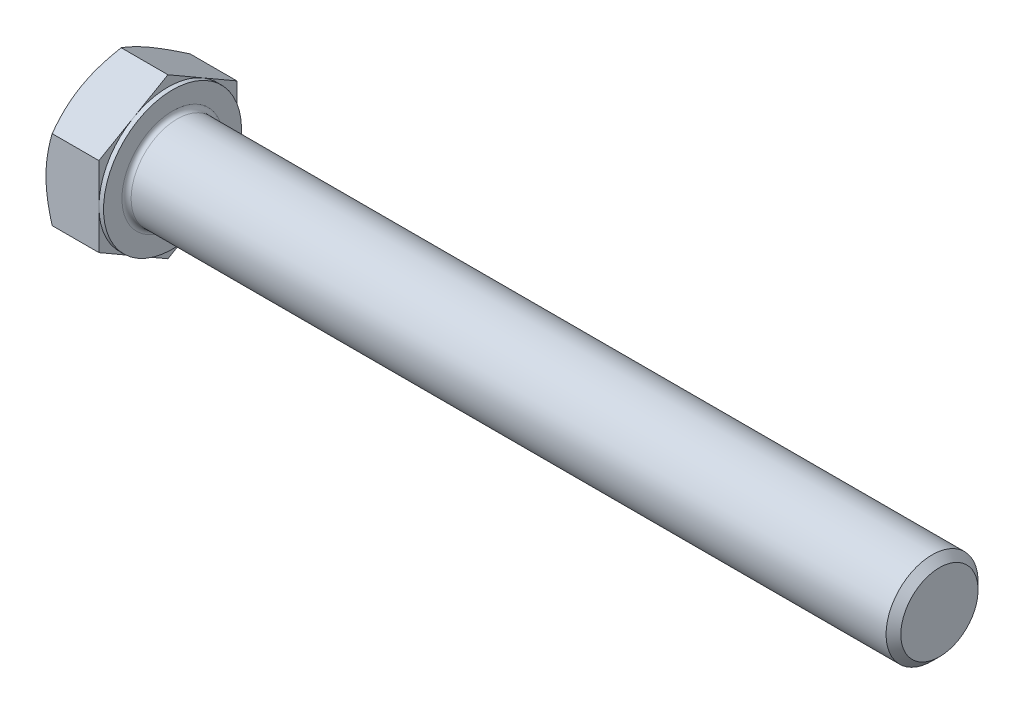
ISO-10303-21;
HEADER;
FILE_DESCRIPTION(('STEP AP214'),'2;1');
FILE_NAME('part.step','',(''),(''),'','','');
FILE_SCHEMA(('AUTOMOTIVE_DESIGN { 1 0 10303 214 1 1 1 1 }'));
ENDSEC;
DATA;
#1=APPLICATION_CONTEXT('core data for automotive mechanical design processes');
#2=APPLICATION_PROTOCOL_DEFINITION('international standard','automotive_design',2000,#1);
#3=PRODUCT_CONTEXT('',#1,'mechanical');
#4=PRODUCT('Part','Part','',(#3));
#5=PRODUCT_RELATED_PRODUCT_CATEGORY('part','',(#4));
#6=PRODUCT_DEFINITION_FORMATION('','',#4);
#7=PRODUCT_DEFINITION_CONTEXT('part definition',#1,'design');
#8=PRODUCT_DEFINITION('design','',#6,#7);
#9=PRODUCT_DEFINITION_SHAPE('','',#8);
#10=(LENGTH_UNIT() NAMED_UNIT(*) SI_UNIT(.MILLI.,.METRE.));
#11=(NAMED_UNIT(*) PLANE_ANGLE_UNIT() SI_UNIT($,.RADIAN.));
#12=(NAMED_UNIT(*) SI_UNIT($,.STERADIAN.) SOLID_ANGLE_UNIT());
#13=UNCERTAINTY_MEASURE_WITH_UNIT(LENGTH_MEASURE(1.E-05),#10,'distance_accuracy_value','');
#14=(GEOMETRIC_REPRESENTATION_CONTEXT(3) GLOBAL_UNCERTAINTY_ASSIGNED_CONTEXT((#13)) GLOBAL_UNIT_ASSIGNED_CONTEXT((#10,
#11,#12)) REPRESENTATION_CONTEXT('',''));
#15=CARTESIAN_POINT('',(0.,0.,0.));
#16=DIRECTION('',(0.,0.,1.));
#17=DIRECTION('',(1.,0.,0.));
#18=AXIS2_PLACEMENT_3D('',#15,#16,#17);
#19=CARTESIAN_POINT('',(7.5,10.3923048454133,0.));
#20=DIRECTION('',(1.,0.,0.));
#21=DIRECTION('',(0.,0.,-1.));
#22=AXIS2_PLACEMENT_3D('',#19,#20,#21);
#23=PLANE('',#22);
#24=CARTESIAN_POINT('',(7.5,0.,0.));
#25=DIRECTION('',(1.,0.,0.));
#26=DIRECTION('',(0.,0.,-1.));
#27=AXIS2_PLACEMENT_3D('',#24,#25,#26);
#28=CIRCLE('',#27,6.6);
#29=CARTESIAN_POINT('',(7.5,0.,-6.6));
#30=VERTEX_POINT('',#29);
#31=EDGE_CURVE('E40',#30,#30,#28,.F.);
#32=ORIENTED_EDGE('',*,*,#31,.T.);
#33=EDGE_LOOP('',(#32));
#34=FACE_BOUND('',#33,.T.);
#35=CARTESIAN_POINT('',(7.5,0.,0.));
#36=DIRECTION('',(1.,0.,0.));
#37=DIRECTION('',(0.,0.,-1.));
#38=AXIS2_PLACEMENT_3D('',#35,#36,#37);
#39=CIRCLE('',#38,9.);
#40=CARTESIAN_POINT('',(7.5,0.,-9.));
#41=VERTEX_POINT('',#40);
#42=EDGE_CURVE('E297',#41,#41,#39,.T.);
#43=ORIENTED_EDGE('',*,*,#42,.T.);
#44=EDGE_LOOP('',(#43));
#45=FACE_BOUND('',#44,.T.);
#46=ADVANCED_FACE('F32',(#34,#45),#23,.T.);
#47=CARTESIAN_POINT('',(0.,0.,0.));
#48=DIRECTION('',(-1.,0.,0.));
#49=DIRECTION('',(0.,0.,1.));
#50=AXIS2_PLACEMENT_3D('',#47,#48,#49);
#51=CYLINDRICAL_SURFACE('',#50,6.);
#52=CARTESIAN_POINT('',(8.1,0.,0.));
#53=DIRECTION('',(1.,0.,0.));
#54=DIRECTION('',(0.,0.,-1.));
#55=AXIS2_PLACEMENT_3D('',#52,#53,#54);
#56=CIRCLE('',#55,6.);
#57=CARTESIAN_POINT('',(8.1,0.,-6.));
#58=VERTEX_POINT('',#57);
#59=EDGE_CURVE('E11',#58,#58,#56,.T.);
#60=ORIENTED_EDGE('',*,*,#59,.T.);
#61=EDGE_LOOP('',(#60));
#62=FACE_BOUND('',#61,.T.);
#63=CARTESIAN_POINT('',(106.536,0.,0.));
#64=DIRECTION('',(-1.,0.,0.));
#65=DIRECTION('',(0.,0.,1.));
#66=AXIS2_PLACEMENT_3D('',#63,#64,#65);
#67=CIRCLE('',#66,6.);
#68=CARTESIAN_POINT('',(106.536,0.,6.));
#69=VERTEX_POINT('',#68);
#70=EDGE_CURVE('E276',#69,#69,#67,.T.);
#71=ORIENTED_EDGE('',*,*,#70,.T.);
#72=EDGE_LOOP('',(#71));
#73=FACE_BOUND('',#72,.T.);
#74=ADVANCED_FACE('F250',(#62,#73),#51,.T.);
#75=CARTESIAN_POINT('',(107.5,0.,0.));
#76=DIRECTION('',(-1.,0.,0.));
#77=DIRECTION('',(0.,0.,1.));
#78=AXIS2_PLACEMENT_3D('',#75,#76,#77);
#79=CONICAL_SURFACE('',#78,5.036,0.78539816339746);
#80=ORIENTED_EDGE('',*,*,#70,.F.);
#81=EDGE_LOOP('',(#80));
#82=FACE_BOUND('',#81,.T.);
#83=CARTESIAN_POINT('',(107.5,0.,0.));
#84=DIRECTION('',(-1.,0.,0.));
#85=DIRECTION('',(0.,0.,1.));
#86=AXIS2_PLACEMENT_3D('',#83,#84,#85);
#87=CIRCLE('',#86,5.036);
#88=CARTESIAN_POINT('',(107.5,0.,5.036));
#89=VERTEX_POINT('',#88);
#90=EDGE_CURVE('E274',#89,#89,#87,.T.);
#91=ORIENTED_EDGE('',*,*,#90,.T.);
#92=EDGE_LOOP('',(#91));
#93=FACE_BOUND('',#92,.T.);
#94=ADVANCED_FACE('F255',(#82,#93),#79,.T.);
#95=CARTESIAN_POINT('',(107.5,0.,0.));
#96=DIRECTION('',(-1.,0.,0.));
#97=DIRECTION('',(0.,0.,1.));
#98=AXIS2_PLACEMENT_3D('',#95,#96,#97);
#99=PLANE('',#98);
#100=ORIENTED_EDGE('',*,*,#90,.F.);
#101=EDGE_LOOP('',(#100));
#102=FACE_BOUND('',#101,.T.);
#103=ADVANCED_FACE('F262',(#102),#99,.F.);
#104=CARTESIAN_POINT('',(6.9,9.,0.));
#105=DIRECTION('',(1.,0.,0.));
#106=DIRECTION('',(0.,0.,-1.));
#107=AXIS2_PLACEMENT_3D('',#104,#105,#106);
#108=PLANE('',#107);
#109=DIRECTION('',(0.,0.500000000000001,0.866025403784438));
#110=VECTOR('',#109,1.);
#111=CARTESIAN_POINT('',(6.9,5.19615242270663,-9.));
#112=LINE('',#111,#110);
#113=CARTESIAN_POINT('',(6.9,5.19615242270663,-9.));
#114=VERTEX_POINT('',#113);
#115=CARTESIAN_POINT('',(6.9,7.79422863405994,-4.50000000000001));
#116=VERTEX_POINT('',#115);
#117=EDGE_CURVE('E164',#114,#116,#112,.T.);
#118=ORIENTED_EDGE('',*,*,#117,.T.);
#119=CARTESIAN_POINT('',(6.9,0.,0.));
#120=DIRECTION('',(-1.,0.,0.));
#121=DIRECTION('',(0.,0.,1.));
#122=AXIS2_PLACEMENT_3D('',#119,#120,#121);
#123=CIRCLE('',#122,9.);
#124=CARTESIAN_POINT('',(6.9,0.,-9.));
#125=VERTEX_POINT('',#124);
#126=EDGE_CURVE('E47',#116,#125,#123,.T.);
#127=ORIENTED_EDGE('',*,*,#126,.T.);
#128=DIRECTION('',(0.,1.,0.));
#129=VECTOR('',#128,1.);
#130=CARTESIAN_POINT('',(6.9,5.19615242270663,-9.));
#131=LINE('',#130,#129);
#132=EDGE_CURVE('E300',#125,#114,#131,.T.);
#133=ORIENTED_EDGE('',*,*,#132,.T.);
#134=EDGE_LOOP('',(#118,#127,#133));
#135=FACE_BOUND('',#134,.T.);
#136=ADVANCED_FACE('F265',(#135),#108,.T.);
#137=CARTESIAN_POINT('',(6.9,10.3923048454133,0.));
#138=VERTEX_POINT('',#137);
#139=EDGE_CURVE('E162',#116,#138,#112,.T.);
#140=ORIENTED_EDGE('',*,*,#139,.T.);
#141=DIRECTION('',(0.,-0.500000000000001,0.866025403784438));
#142=VECTOR('',#141,1.);
#143=CARTESIAN_POINT('',(6.9,10.3923048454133,0.));
#144=LINE('',#143,#142);
#145=CARTESIAN_POINT('',(6.9,7.79422863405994,4.50000000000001));
#146=VERTEX_POINT('',#145);
#147=EDGE_CURVE('E161',#138,#146,#144,.T.);
#148=ORIENTED_EDGE('',*,*,#147,.T.);
#149=EDGE_CURVE('E150',#146,#116,#123,.T.);
#150=ORIENTED_EDGE('',*,*,#149,.T.);
#151=EDGE_LOOP('',(#140,#148,#150));
#152=FACE_BOUND('',#151,.T.);
#153=ADVANCED_FACE('F270',(#152),#108,.T.);
#154=CARTESIAN_POINT('',(6.9,5.19615242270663,9.));
#155=VERTEX_POINT('',#154);
#156=EDGE_CURVE('E129',#146,#155,#144,.T.);
#157=ORIENTED_EDGE('',*,*,#156,.T.);
#158=DIRECTION('',(0.,-1.,0.));
#159=VECTOR('',#158,1.);
#160=CARTESIAN_POINT('',(6.9,5.19615242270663,9.));
#161=LINE('',#160,#159);
#162=CARTESIAN_POINT('',(6.9,0.,9.));
#163=VERTEX_POINT('',#162);
#164=EDGE_CURVE('E123',#155,#163,#161,.T.);
#165=ORIENTED_EDGE('',*,*,#164,.T.);
#166=EDGE_CURVE('E127',#163,#146,#123,.T.);
#167=ORIENTED_EDGE('',*,*,#166,.T.);
#168=EDGE_LOOP('',(#157,#165,#167));
#169=FACE_BOUND('',#168,.T.);
#170=ADVANCED_FACE('F125',(#169),#108,.T.);
#171=CARTESIAN_POINT('',(6.9,-5.1961524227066,9.));
#172=VERTEX_POINT('',#171);
#173=EDGE_CURVE('E133',#163,#172,#161,.T.);
#174=ORIENTED_EDGE('',*,*,#173,.T.);
#175=DIRECTION('',(0.,-0.500000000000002,-0.866025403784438));
#176=VECTOR('',#175,1.);
#177=CARTESIAN_POINT('',(6.9,-10.3923048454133,0.));
#178=LINE('',#177,#176);
#179=CARTESIAN_POINT('',(6.9,-7.79422863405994,4.50000000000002));
#180=VERTEX_POINT('',#179);
#181=EDGE_CURVE('E140',#172,#180,#178,.T.);
#182=ORIENTED_EDGE('',*,*,#181,.T.);
#183=EDGE_CURVE('E137',#180,#163,#123,.T.);
#184=ORIENTED_EDGE('',*,*,#183,.T.);
#185=EDGE_LOOP('',(#174,#182,#184));
#186=FACE_BOUND('',#185,.T.);
#187=ADVANCED_FACE('F138',(#186),#108,.T.);
#188=CARTESIAN_POINT('',(6.9,-10.3923048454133,0.));
#189=VERTEX_POINT('',#188);
#190=EDGE_CURVE('E156',#180,#189,#178,.T.);
#191=ORIENTED_EDGE('',*,*,#190,.T.);
#192=DIRECTION('',(0.,0.499999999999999,-0.866025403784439));
#193=VECTOR('',#192,1.);
#194=CARTESIAN_POINT('',(6.9,-5.19615242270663,-9.));
#195=LINE('',#194,#193);
#196=CARTESIAN_POINT('',(6.9,-7.79422863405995,-4.49999999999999));
#197=VERTEX_POINT('',#196);
#198=EDGE_CURVE('E338',#189,#197,#195,.T.);
#199=ORIENTED_EDGE('',*,*,#198,.T.);
#200=EDGE_CURVE('E144',#197,#180,#123,.T.);
#201=ORIENTED_EDGE('',*,*,#200,.T.);
#202=EDGE_LOOP('',(#191,#199,#201));
#203=FACE_BOUND('',#202,.T.);
#204=ADVANCED_FACE('F339',(#203),#108,.T.);
#205=CARTESIAN_POINT('',(6.9,-5.19615242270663,-9.));
#206=VERTEX_POINT('',#205);
#207=EDGE_CURVE('E151',#197,#206,#195,.T.);
#208=ORIENTED_EDGE('',*,*,#207,.T.);
#209=EDGE_CURVE('E301',#206,#125,#131,.T.);
#210=ORIENTED_EDGE('',*,*,#209,.T.);
#211=EDGE_CURVE('E308',#125,#197,#123,.T.);
#212=ORIENTED_EDGE('',*,*,#211,.T.);
#213=EDGE_LOOP('',(#208,#210,#212));
#214=FACE_BOUND('',#213,.T.);
#215=ADVANCED_FACE('F271',(#214),#108,.T.);
#216=CARTESIAN_POINT('',(0.,0.,0.));
#217=DIRECTION('',(-1.,0.,0.));
#218=DIRECTION('',(0.,0.,1.));
#219=AXIS2_PLACEMENT_3D('',#216,#217,#218);
#220=CYLINDRICAL_SURFACE('',#219,9.);
#221=ORIENTED_EDGE('',*,*,#126,.F.);
#222=ORIENTED_EDGE('',*,*,#149,.F.);
#223=ORIENTED_EDGE('',*,*,#166,.F.);
#224=ORIENTED_EDGE('',*,*,#183,.F.);
#225=ORIENTED_EDGE('',*,*,#200,.F.);
#226=ORIENTED_EDGE('',*,*,#211,.F.);
#227=EDGE_LOOP('',(#221,#222,#223,#224,#225,#226));
#228=FACE_BOUND('',#227,.T.);
#229=ORIENTED_EDGE('',*,*,#42,.F.);
#230=EDGE_LOOP('',(#229));
#231=FACE_BOUND('',#230,.T.);
#232=ADVANCED_FACE('F147',(#228,#231),#220,.T.);
#233=CARTESIAN_POINT('',(0.,10.3923048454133,0.));
#234=DIRECTION('',(1.,0.,0.));
#235=DIRECTION('',(0.,0.,-1.));
#236=AXIS2_PLACEMENT_3D('',#233,#234,#235);
#237=PLANE('',#236);
#238=CARTESIAN_POINT('',(0.,0.,0.));
#239=DIRECTION('',(1.,0.,0.));
#240=DIRECTION('',(0.,0.,-1.));
#241=AXIS2_PLACEMENT_3D('',#238,#239,#240);
#242=CIRCLE('',#241,9.);
#243=CARTESIAN_POINT('',(0.,0.,-9.));
#244=VERTEX_POINT('',#243);
#245=CARTESIAN_POINT('',(0.,7.79422863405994,-4.50000000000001));
#246=VERTEX_POINT('',#245);
#247=EDGE_CURVE('E296',#244,#246,#242,.T.);
#248=ORIENTED_EDGE('',*,*,#247,.F.);
#249=CARTESIAN_POINT('',(0.,-7.79422863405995,-4.49999999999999));
#250=VERTEX_POINT('',#249);
#251=EDGE_CURVE('E292',#250,#244,#242,.T.);
#252=ORIENTED_EDGE('',*,*,#251,.F.);
#253=CARTESIAN_POINT('',(0.,-7.79422863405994,4.50000000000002));
#254=VERTEX_POINT('',#253);
#255=EDGE_CURVE('E295',#254,#250,#242,.T.);
#256=ORIENTED_EDGE('',*,*,#255,.F.);
#257=CARTESIAN_POINT('',(0.,0.,9.));
#258=VERTEX_POINT('',#257);
#259=EDGE_CURVE('E331',#258,#254,#242,.T.);
#260=ORIENTED_EDGE('',*,*,#259,.F.);
#261=CARTESIAN_POINT('',(0.,0.,0.));
#262=DIRECTION('',(-1.,0.,0.));
#263=DIRECTION('',(0.,0.,1.));
#264=AXIS2_PLACEMENT_3D('',#261,#262,#263);
#265=CIRCLE('',#264,9.);
#266=CARTESIAN_POINT('',(0.,7.79422863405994,4.50000000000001));
#267=VERTEX_POINT('',#266);
#268=EDGE_CURVE('E165',#258,#267,#265,.T.);
#269=ORIENTED_EDGE('',*,*,#268,.T.);
#270=EDGE_CURVE('E354',#246,#267,#242,.T.);
#271=ORIENTED_EDGE('',*,*,#270,.F.);
#272=EDGE_LOOP('',(#248,#252,#256,#260,#269,#271));
#273=FACE_BOUND('',#272,.T.);
#274=ADVANCED_FACE('F196',(#273),#237,.F.);
#275=CARTESIAN_POINT('',(0.,0.,0.));
#276=DIRECTION('',(1.,0.,0.));
#277=DIRECTION('',(0.,0.,-1.));
#278=AXIS2_PLACEMENT_3D('',#275,#276,#277);
#279=CONICAL_SURFACE('',#278,9.,1.0471975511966);
#280=CARTESIAN_POINT('',(0.803914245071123,5.19603695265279,9.0002));
#281=CARTESIAN_POINT('',(0.737982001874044,5.31024090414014,8.80239295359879));
#282=CARTESIAN_POINT('',(0.675041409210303,5.42489028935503,8.60381439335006));
#283=CARTESIAN_POINT('',(0.555968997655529,5.65512011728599,8.20504463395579));
#284=CARTESIAN_POINT('',(0.499840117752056,5.77070093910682,8.00485277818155));
#285=CARTESIAN_POINT('',(0.395151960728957,6.00300811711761,7.60248494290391));
#286=CARTESIAN_POINT('',(0.346610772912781,6.11973652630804,7.40030540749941));
#287=CARTESIAN_POINT('',(0.258148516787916,6.35398725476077,6.99457124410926));
#288=CARTESIAN_POINT('',(0.218225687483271,6.47150940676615,6.7910169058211));
#289=CARTESIAN_POINT('',(0.148684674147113,6.70436794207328,6.38769409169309));
#290=CARTESIAN_POINT('',(0.118837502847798,6.81968712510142,6.187955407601));
#291=CARTESIAN_POINT('',(0.0687933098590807,7.05084147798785,5.78758432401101));
#292=CARTESIAN_POINT('',(0.04859543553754,7.16667660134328,5.5869520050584));
#293=CARTESIAN_POINT('',(0.0183543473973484,7.39854776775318,5.18533936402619));
#294=CARTESIAN_POINT('',(0.00829960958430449,7.51458343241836,4.98435969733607));
#295=CARTESIAN_POINT('',(-0.00143766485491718,7.74676155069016,4.58221540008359));
#296=CARTESIAN_POINT('',(-0.00112052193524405,7.86290400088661,4.38105077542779));
#297=CARTESIAN_POINT('',(0.00916395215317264,8.08003584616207,4.00496738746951));
#298=CARTESIAN_POINT('',(0.0178767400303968,8.18104055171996,3.83002210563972));
#299=CARTESIAN_POINT('',(0.0429773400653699,8.38281337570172,3.48054132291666));
#300=CARTESIAN_POINT('',(0.0593656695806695,8.4835814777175,3.30600585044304));
#301=CARTESIAN_POINT('',(0.11965655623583,8.7854956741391,2.7830751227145));
#302=CARTESIAN_POINT('',(0.174677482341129,8.98610736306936,2.43560548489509));
#303=CARTESIAN_POINT('',(0.312230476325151,9.38945876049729,1.73698037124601));
#304=CARTESIAN_POINT('',(0.395345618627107,9.59214699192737,1.38591405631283));
#305=CARTESIAN_POINT('',(0.583982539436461,9.99450087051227,0.689016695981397));
#306=CARTESIAN_POINT('',(0.689460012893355,10.1941716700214,0.343176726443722));
#307=CARTESIAN_POINT('',(0.803914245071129,10.3924203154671,-0.000200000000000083));
#308=B_SPLINE_CURVE_WITH_KNOTS('',3,(#280,#281,#282,#283,#284,#285,#286,#287,#288,#289,#290,
#291,#292,#293,#294,#295,#296,#297,#298,#299,#300,#301,#302,#303,#304,#305,#306,#307),
.UNSPECIFIED.,.F.,.F.,(4,2,2,2,2,2,2,2,2,2,2,2,2,4),(0.,0.713219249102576,1.42674513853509,
2.14194697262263,2.8570025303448,3.55449749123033,4.25193080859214,4.94857085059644,
5.64518936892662,6.25162976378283,6.8581110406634,8.07193747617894,9.31268391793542,
10.5509947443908),.UNSPECIFIED.);
#309=CARTESIAN_POINT('',(0.803847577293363,10.3923048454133,0.));
#310=VERTEX_POINT('',#309);
#311=EDGE_CURVE('E216',#267,#310,#308,.T.);
#312=ORIENTED_EDGE('',*,*,#311,.T.);
#313=CARTESIAN_POINT('',(0.803914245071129,10.3924203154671,0.000200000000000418));
#314=CARTESIAN_POINT('',(0.73798200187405,10.2782163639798,-0.197607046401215));
#315=CARTESIAN_POINT('',(0.675041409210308,10.1635669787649,-0.396185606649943));
#316=CARTESIAN_POINT('',(0.555968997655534,9.93333715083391,-0.794955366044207));
#317=CARTESIAN_POINT('',(0.499840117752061,9.81775632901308,-0.995147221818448));
#318=CARTESIAN_POINT('',(0.395151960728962,9.58544915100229,-1.39751505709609));
#319=CARTESIAN_POINT('',(0.346610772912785,9.46872074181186,-1.59969459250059));
#320=CARTESIAN_POINT('',(0.25814851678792,9.23447001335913,-2.00542875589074));
#321=CARTESIAN_POINT('',(0.218225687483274,9.11694786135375,-2.20898309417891));
#322=CARTESIAN_POINT('',(0.148684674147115,8.88408932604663,-2.61230590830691));
#323=CARTESIAN_POINT('',(0.1188375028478,8.76877014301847,-2.812044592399));
#324=CARTESIAN_POINT('',(0.0687933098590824,8.53761579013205,-3.21241567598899));
#325=CARTESIAN_POINT('',(0.048595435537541,8.42178066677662,-3.4130479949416));
#326=CARTESIAN_POINT('',(0.0183543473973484,8.18990950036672,-3.81466063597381));
#327=CARTESIAN_POINT('',(0.00829960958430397,8.07387383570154,-4.01564030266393));
#328=CARTESIAN_POINT('',(-0.00143766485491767,7.84169571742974,-4.41778459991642));
#329=CARTESIAN_POINT('',(-0.00112052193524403,7.72555326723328,-4.61894922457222));
#330=CARTESIAN_POINT('',(0.00916395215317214,7.50842142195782,-4.9950326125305));
#331=CARTESIAN_POINT('',(0.0178767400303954,7.40741671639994,-5.16997789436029));
#332=CARTESIAN_POINT('',(0.042977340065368,7.20564389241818,-5.51945867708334));
#333=CARTESIAN_POINT('',(0.0593656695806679,7.1048757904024,-5.69399414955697));
#334=CARTESIAN_POINT('',(0.119656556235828,6.8029615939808,-6.2169248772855));
#335=CARTESIAN_POINT('',(0.174677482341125,6.60234990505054,-6.56439451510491));
#336=CARTESIAN_POINT('',(0.312230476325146,6.1989985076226,-7.263019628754));
#337=CARTESIAN_POINT('',(0.395345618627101,5.99631027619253,-7.61408594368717));
#338=CARTESIAN_POINT('',(0.583982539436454,5.59395639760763,-8.3109833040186));
#339=CARTESIAN_POINT('',(0.689460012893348,5.39428559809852,-8.65682327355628));
#340=CARTESIAN_POINT('',(0.803914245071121,5.19603695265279,-9.0002));
#341=B_SPLINE_CURVE_WITH_KNOTS('',3,(#313,#314,#315,#316,#317,#318,#319,#320,#321,#322,#323,
#324,#325,#326,#327,#328,#329,#330,#331,#332,#333,#334,#335,#336,#337,#338,#339,#340),
.UNSPECIFIED.,.F.,.F.,(4,2,2,2,2,2,2,2,2,2,2,2,2,4),(0.,0.713219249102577,1.42674513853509,
2.14194697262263,2.8570025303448,3.55449749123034,4.25193080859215,4.94857085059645,
5.64518936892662,6.25162976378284,6.85811104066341,8.07193747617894,9.31268391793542,
10.5509947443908),.UNSPECIFIED.);
#342=EDGE_CURVE('E55',#310,#246,#341,.T.);
#343=ORIENTED_EDGE('',*,*,#342,.T.);
#344=ORIENTED_EDGE('',*,*,#270,.T.);
#345=EDGE_LOOP('',(#312,#343,#344));
#346=FACE_BOUND('',#345,.T.);
#347=ADVANCED_FACE('F355',(#346),#279,.T.);
#348=CARTESIAN_POINT('',(4.5030834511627,-14.1853984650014,8.99999999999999));
#349=CARTESIAN_POINT('',(4.31054430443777,-13.7903499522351,8.99999999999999));
#350=CARTESIAN_POINT('',(4.11978647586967,-13.3944187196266,8.99999999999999));
#351=CARTESIAN_POINT('',(3.74283090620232,-12.6003222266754,8.99999999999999));
#352=CARTESIAN_POINT('',(3.55663384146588,-12.2021566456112,9.));
#353=CARTESIAN_POINT('',(3.18890856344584,-11.4011783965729,9.));
#354=CARTESIAN_POINT('',(3.00740939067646,-10.9983523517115,9.));
#355=CARTESIAN_POINT('',(2.65153988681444,-10.1895752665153,9.));
#356=CARTESIAN_POINT('',(2.47716923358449,-9.7836243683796,9.));
#357=CARTESIAN_POINT('',(2.13161244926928,-8.95398189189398,9.));
#358=CARTESIAN_POINT('',(1.96074001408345,-8.53015895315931,9.));
#359=CARTESIAN_POINT('',(1.63138410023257,-7.67764040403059,9.));
#360=CARTESIAN_POINT('',(1.47290197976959,-7.24894426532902,9.));
#361=CARTESIAN_POINT('',(1.17232155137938,-6.38672363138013,9.));
#362=CARTESIAN_POINT('',(1.03019194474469,-5.95321016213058,9.));
#363=CARTESIAN_POINT('',(0.766724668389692,-5.07998336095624,9.));
#364=CARTESIAN_POINT('',(0.645380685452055,-4.64027195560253,9.));
#365=CARTESIAN_POINT('',(0.429822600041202,-3.75682505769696,9.));
#366=CARTESIAN_POINT('',(0.335452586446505,-3.31312863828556,9.));
#367=CARTESIAN_POINT('',(0.218090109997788,-2.64336713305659,9.));
#368=CARTESIAN_POINT('',(0.182999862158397,-2.41939560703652,9.));
#369=CARTESIAN_POINT('',(0.121565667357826,-1.97026354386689,9.));
#370=CARTESIAN_POINT('',(0.0952208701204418,-1.74510312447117,9.));
#371=CARTESIAN_POINT('',(0.0521451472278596,-1.2969348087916,9.));
#372=CARTESIAN_POINT('',(0.0352889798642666,-1.0739390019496,9.));
#373=CARTESIAN_POINT('',(0.0110310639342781,-0.627433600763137,9.));
#374=CARTESIAN_POINT('',(0.00362915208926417,-0.403924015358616,9.));
#375=CARTESIAN_POINT('',(-0.00154262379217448,0.0432079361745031,9.));
#376=CARTESIAN_POINT('',(0.000687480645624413,0.266830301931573,9.));
#377=CARTESIAN_POINT('',(0.0147226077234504,0.713776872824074,9.));
#378=CARTESIAN_POINT('',(0.0265280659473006,0.937101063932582,9.));
#379=CARTESIAN_POINT('',(0.0656502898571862,1.46707211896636,9.));
#380=CARTESIAN_POINT('',(0.0971347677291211,1.77341845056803,9.));
#381=CARTESIAN_POINT('',(0.176454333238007,2.38397028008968,9.));
#382=CARTESIAN_POINT('',(0.224291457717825,2.68817550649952,9.));
#383=CARTESIAN_POINT('',(0.38980640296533,3.59715813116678,9.));
#384=CARTESIAN_POINT('',(0.529461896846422,4.19799412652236,9.));
#385=CARTESIAN_POINT('',(0.77333187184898,5.09670706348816,9.));
#386=CARTESIAN_POINT('',(0.861532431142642,5.39919910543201,9.));
#387=CARTESIAN_POINT('',(1.04752099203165,6.00125026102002,9.));
#388=CARTESIAN_POINT('',(1.14530906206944,6.30080935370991,9.));
#389=CARTESIAN_POINT('',(1.34886866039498,6.89708058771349,9.));
#390=CARTESIAN_POINT('',(1.45463787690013,7.19379352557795,9.));
#391=CARTESIAN_POINT('',(1.67287301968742,7.78473287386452,9.));
#392=CARTESIAN_POINT('',(1.78533883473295,8.07895932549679,9.));
#393=CARTESIAN_POINT('',(2.07523735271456,8.81619444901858,9.));
#394=CARTESIAN_POINT('',(2.25629467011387,9.25777584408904,9.));
#395=CARTESIAN_POINT('',(2.62827522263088,10.1367776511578,9.));
#396=CARTESIAN_POINT('',(2.819199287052,10.5741977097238,9.));
#397=CARTESIAN_POINT('',(3.20877963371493,11.4457286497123,9.));
#398=CARTESIAN_POINT('',(3.40743823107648,11.8798384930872,9.));
#399=CARTESIAN_POINT('',(3.81079737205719,12.7452179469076,9.));
#400=CARTESIAN_POINT('',(4.01549773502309,13.176487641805,9.00000000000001));
#401=CARTESIAN_POINT('',(4.43000777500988,14.0372827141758,9.00000000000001));
#402=CARTESIAN_POINT('',(4.63982402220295,14.4668049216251,9.00000000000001));
#403=CARTESIAN_POINT('',(5.06336871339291,15.3239162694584,9.00000000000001));
#404=CARTESIAN_POINT('',(5.27709718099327,15.7515053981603,9.00000000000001));
#405=CARTESIAN_POINT('',(5.70771289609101,16.6049951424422,9.00000000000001));
#406=CARTESIAN_POINT('',(5.92459958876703,17.0308960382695,9.00000000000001));
#407=CARTESIAN_POINT('',(6.36101693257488,17.8813418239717,9.00000000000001));
#408=CARTESIAN_POINT('',(6.58054759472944,18.305886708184,9.00000000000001));
#409=CARTESIAN_POINT('',(7.20096689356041,19.4981240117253,9.00000000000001));
#410=CARTESIAN_POINT('',(7.60436223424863,20.2645118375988,9.00000000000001));
#411=CARTESIAN_POINT('',(8.41646747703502,21.7945065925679,9.00000000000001));
#412=CARTESIAN_POINT('',(8.82517763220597,22.558113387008,9.00000000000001));
#413=CARTESIAN_POINT('',(9.64538992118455,24.0808854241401,9.00000000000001));
#414=CARTESIAN_POINT('',(10.0568800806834,24.8400571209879,9.00000000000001));
#415=CARTESIAN_POINT('',(10.6764233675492,25.9775231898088,9.00000000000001));
#416=CARTESIAN_POINT('',(10.8833155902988,26.3564507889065,9.00000000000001));
#417=CARTESIAN_POINT('',(11.2977907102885,27.1139273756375,9.00000000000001));
#418=CARTESIAN_POINT('',(11.5053736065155,27.492476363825,9.00000000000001));
#419=CARTESIAN_POINT('',(11.7132605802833,27.8708583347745,9.00000000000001));
#420=B_SPLINE_CURVE_WITH_KNOTS('',3,(#348,#349,#350,#351,#352,#353,#354,#355,#356,#357,#358,
#359,#360,#361,#362,#363,#364,#365,#366,#367,#368,#369,#370,#371,#372,#373,#374,#375,#376,#377,
#378,#379,#380,#381,#382,#383,#384,#385,#386,#387,#388,#389,#390,#391,#392,#393,#394,#395,#396,
#397,#398,#399,#400,#401,#402,#403,#404,#405,#406,#407,#408,#409,#410,#411,#412,#413,#414,#415,
#416,#417,#418,#419),.UNSPECIFIED.,.F.,.F.,(4,2,2,2,2,2,2,2,2,2,2,2,2,2,2,2,2,2,2,2,2,2,2,2,2,2,
2,2,2,2,2,2,2,2,2,4),(0.,1.31842765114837,2.6370496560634,3.96247407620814,5.28783853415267,
6.65860358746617,8.029518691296,9.3977646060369,10.7655942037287,12.1253499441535,
12.8053173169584,13.4852185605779,14.1559216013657,14.8266130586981,15.4973023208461,
16.1680220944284,17.0913849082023,18.0148627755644,19.862742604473,20.8079230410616,
21.7531102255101,22.6980246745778,23.6429234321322,25.0745302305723,26.5062575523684,
27.9384167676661,29.3705332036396,30.8045973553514,32.2386701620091,33.6724940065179,
35.1063238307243,37.7045032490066,40.3028068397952,42.8933552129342,44.1885437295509,
45.4837303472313),.UNSPECIFIED.);
#421=CARTESIAN_POINT('',(0.803847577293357,5.19615242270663,9.));
#422=VERTEX_POINT('',#421);
#423=EDGE_CURVE('E230',#258,#422,#420,.T.);
#424=ORIENTED_EDGE('',*,*,#423,.T.);
#425=EDGE_CURVE('E229',#422,#267,#308,.T.);
#426=ORIENTED_EDGE('',*,*,#425,.T.);
#427=ORIENTED_EDGE('',*,*,#268,.F.);
#428=EDGE_LOOP('',(#424,#426,#427));
#429=FACE_BOUND('',#428,.T.);
#430=ADVANCED_FACE('F325',(#429),#279,.T.);
#431=CARTESIAN_POINT('',(0.803847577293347,-5.1961524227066,9.));
#432=VERTEX_POINT('',#431);
#433=EDGE_CURVE('E277',#432,#258,#420,.T.);
#434=ORIENTED_EDGE('',*,*,#433,.T.);
#435=ORIENTED_EDGE('',*,*,#259,.T.);
#436=CARTESIAN_POINT('',(0.803914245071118,-10.3924203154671,-0.000200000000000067));
#437=CARTESIAN_POINT('',(0.737982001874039,-10.2782163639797,0.197607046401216));
#438=CARTESIAN_POINT('',(0.675041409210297,-10.1635669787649,0.396185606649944));
#439=CARTESIAN_POINT('',(0.555968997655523,-9.93333715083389,0.794955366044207));
#440=CARTESIAN_POINT('',(0.499840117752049,-9.81775632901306,0.995147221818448));
#441=CARTESIAN_POINT('',(0.39515196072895,-9.58544915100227,1.39751505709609));
#442=CARTESIAN_POINT('',(0.346610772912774,-9.46872074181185,1.59969459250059));
#443=CARTESIAN_POINT('',(0.258148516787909,-9.23447001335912,2.00542875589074));
#444=CARTESIAN_POINT('',(0.218225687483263,-9.11694786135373,2.2089830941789));
#445=CARTESIAN_POINT('',(0.148684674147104,-8.88408932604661,2.6123059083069));
#446=CARTESIAN_POINT('',(0.118837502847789,-8.76877014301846,2.81204459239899));
#447=CARTESIAN_POINT('',(0.0687933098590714,-8.53761579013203,3.21241567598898));
#448=CARTESIAN_POINT('',(0.0485954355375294,-8.4217806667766,3.41304799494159));
#449=CARTESIAN_POINT('',(0.0183543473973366,-8.1899095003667,3.8146606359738));
#450=CARTESIAN_POINT('',(0.00829960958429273,-8.07387383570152,4.01564030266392));
#451=CARTESIAN_POINT('',(-0.00143766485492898,-7.84169571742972,4.41778459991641));
#452=CARTESIAN_POINT('',(-0.00112052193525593,-7.72555326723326,4.61894922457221));
#453=CARTESIAN_POINT('',(0.00916395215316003,-7.5084214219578,4.99503261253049));
#454=CARTESIAN_POINT('',(0.0178767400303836,-7.40741671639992,5.16997789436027));
#455=CARTESIAN_POINT('',(0.0429773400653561,-7.20564389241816,5.51945867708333));
#456=CARTESIAN_POINT('',(0.0593656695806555,-7.10487579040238,5.69399414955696));
#457=CARTESIAN_POINT('',(0.119656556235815,-6.80296159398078,6.21692487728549));
#458=CARTESIAN_POINT('',(0.174677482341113,-6.60234990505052,6.5643945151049));
#459=CARTESIAN_POINT('',(0.312230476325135,-6.19899850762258,7.26301962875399));
#460=CARTESIAN_POINT('',(0.39534561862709,-5.9963102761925,7.61408594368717));
#461=CARTESIAN_POINT('',(0.583982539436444,-5.5939563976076,8.3109833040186));
#462=CARTESIAN_POINT('',(0.689460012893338,-5.3942855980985,8.65682327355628));
#463=CARTESIAN_POINT('',(0.803914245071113,-5.19603695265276,9.0002));
#464=B_SPLINE_CURVE_WITH_KNOTS('',3,(#436,#437,#438,#439,#440,#441,#442,#443,#444,#445,#446,
#447,#448,#449,#450,#451,#452,#453,#454,#455,#456,#457,#458,#459,#460,#461,#462,#463),
.UNSPECIFIED.,.F.,.F.,(4,2,2,2,2,2,2,2,2,2,2,2,2,4),(0.,0.713219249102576,1.42674513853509,
2.14194697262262,2.8570025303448,3.55449749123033,4.25193080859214,4.94857085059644,
5.64518936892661,6.25162976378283,6.8581110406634,8.07193747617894,9.31268391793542,
10.5509947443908),.UNSPECIFIED.);
#465=EDGE_CURVE('E218',#254,#432,#464,.T.);
#466=ORIENTED_EDGE('',*,*,#465,.T.);
#467=EDGE_LOOP('',(#434,#435,#466));
#468=FACE_BOUND('',#467,.T.);
#469=ADVANCED_FACE('F185',(#468),#279,.T.);
#470=CARTESIAN_POINT('',(0.803847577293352,-10.3923048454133,0.));
#471=VERTEX_POINT('',#470);
#472=EDGE_CURVE('E210',#471,#254,#464,.T.);
#473=ORIENTED_EDGE('',*,*,#472,.T.);
#474=ORIENTED_EDGE('',*,*,#255,.T.);
#475=CARTESIAN_POINT('',(0.803914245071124,-5.1960369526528,-9.0002));
#476=CARTESIAN_POINT('',(0.737982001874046,-5.31024090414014,-8.80239295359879));
#477=CARTESIAN_POINT('',(0.675041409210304,-5.42489028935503,-8.60381439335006));
#478=CARTESIAN_POINT('',(0.555968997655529,-5.65512011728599,-8.20504463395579));
#479=CARTESIAN_POINT('',(0.499840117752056,-5.77070093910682,-8.00485277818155));
#480=CARTESIAN_POINT('',(0.395151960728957,-6.00300811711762,-7.60248494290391));
#481=CARTESIAN_POINT('',(0.346610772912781,-6.11973652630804,-7.40030540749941));
#482=CARTESIAN_POINT('',(0.258148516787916,-6.35398725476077,-6.99457124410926));
#483=CARTESIAN_POINT('',(0.21822568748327,-6.47150940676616,-6.79101690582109));
#484=CARTESIAN_POINT('',(0.148684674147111,-6.70436794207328,-6.38769409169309));
#485=CARTESIAN_POINT('',(0.118837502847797,-6.81968712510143,-6.187955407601));
#486=CARTESIAN_POINT('',(0.0687933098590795,-7.05084147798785,-5.78758432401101));
#487=CARTESIAN_POINT('',(0.0485954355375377,-7.16667660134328,-5.5869520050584));
#488=CARTESIAN_POINT('',(0.018354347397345,-7.39854776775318,-5.18533936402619));
#489=CARTESIAN_POINT('',(0.00829960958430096,-7.51458343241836,-4.98435969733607));
#490=CARTESIAN_POINT('',(-0.00143766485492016,-7.74676155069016,-4.58221540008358));
#491=CARTESIAN_POINT('',(-0.00112052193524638,-7.86290400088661,-4.38105077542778));
#492=CARTESIAN_POINT('',(0.00916395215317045,-8.08003584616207,-4.0049673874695));
#493=CARTESIAN_POINT('',(0.0178767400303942,-8.18104055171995,-3.83002210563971));
#494=CARTESIAN_POINT('',(0.0429773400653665,-8.38281337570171,-3.48054132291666));
#495=CARTESIAN_POINT('',(0.0593656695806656,-8.4835814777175,-3.30600585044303));
#496=CARTESIAN_POINT('',(0.119656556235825,-8.78549567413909,-2.7830751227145));
#497=CARTESIAN_POINT('',(0.174677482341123,-8.98610736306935,-2.43560548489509));
#498=CARTESIAN_POINT('',(0.312230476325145,-9.38945876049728,-1.736980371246));
#499=CARTESIAN_POINT('',(0.3953456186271,-9.59214699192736,-1.38591405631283));
#500=CARTESIAN_POINT('',(0.583982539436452,-9.99450087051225,-0.689016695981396));
#501=CARTESIAN_POINT('',(0.689460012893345,-10.1941716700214,-0.343176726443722));
#502=CARTESIAN_POINT('',(0.803914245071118,-10.3924203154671,0.000200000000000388));
#503=B_SPLINE_CURVE_WITH_KNOTS('',3,(#475,#476,#477,#478,#479,#480,#481,#482,#483,#484,#485,
#486,#487,#488,#489,#490,#491,#492,#493,#494,#495,#496,#497,#498,#499,#500,#501,#502),
.UNSPECIFIED.,.F.,.F.,(4,2,2,2,2,2,2,2,2,2,2,2,2,4),(0.,0.713219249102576,1.42674513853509,
2.14194697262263,2.8570025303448,3.55449749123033,4.25193080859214,4.94857085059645,
5.64518936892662,6.25162976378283,6.8581110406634,8.07193747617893,9.31268391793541,
10.5509947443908),.UNSPECIFIED.);
#504=EDGE_CURVE('E217',#250,#471,#503,.T.);
#505=ORIENTED_EDGE('',*,*,#504,.T.);
#506=EDGE_LOOP('',(#473,#474,#505));
#507=FACE_BOUND('',#506,.T.);
#508=ADVANCED_FACE('F353',(#507),#279,.T.);
#509=CARTESIAN_POINT('',(0.803847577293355,5.19615242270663,-9.));
#510=VERTEX_POINT('',#509);
#511=EDGE_CURVE('E219',#246,#510,#341,.T.);
#512=ORIENTED_EDGE('',*,*,#511,.T.);
#513=CARTESIAN_POINT('',(4.50308345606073,-14.1853984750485,-9.));
#514=CARTESIAN_POINT('',(4.31054430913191,-13.7903499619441,-9.));
#515=CARTESIAN_POINT('',(4.11978648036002,-13.3944187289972,-9.));
#516=CARTESIAN_POINT('',(3.74283091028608,-12.6003222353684,-9.));
#517=CARTESIAN_POINT('',(3.55663384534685,-12.2021566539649,-9.));
#518=CARTESIAN_POINT('',(3.1889085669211,-11.4011784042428,-9.));
#519=CARTESIAN_POINT('',(3.00740939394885,-10.998352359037,-9.));
#520=CARTESIAN_POINT('',(2.65153988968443,-10.1895752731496,-9.));
#521=CARTESIAN_POINT('',(2.47716923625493,-9.78362437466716,-9.));
#522=CARTESIAN_POINT('',(2.13161245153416,-8.95398189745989,-9.));
#523=CARTESIAN_POINT('',(1.96074001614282,-8.53015895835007,-9.));
#524=CARTESIAN_POINT('',(1.63138410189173,-7.67764040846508,-9.));
#525=CARTESIAN_POINT('',(1.47290198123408,-7.24894426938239,-9.));
#526=CARTESIAN_POINT('',(1.17232155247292,-6.38672363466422,-9.));
#527=CARTESIAN_POINT('',(1.0301919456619,-5.95321016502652,-9.));
#528=CARTESIAN_POINT('',(0.766724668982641,-5.07998336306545,-9.));
#529=CARTESIAN_POINT('',(0.645380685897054,-4.64027195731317,-9.));
#530=CARTESIAN_POINT('',(0.429822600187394,-3.75682505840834,-9.));
#531=CARTESIAN_POINT('',(0.335452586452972,-3.31312863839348,-9.));
#532=CARTESIAN_POINT('',(0.218090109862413,-2.64336713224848,-9.));
#533=CARTESIAN_POINT('',(0.182999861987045,-2.41939560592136,-9.));
#534=CARTESIAN_POINT('',(0.12156566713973,-1.97026354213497,-9.));
#535=CARTESIAN_POINT('',(0.0952208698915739,-1.74510312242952,-9.));
#536=CARTESIAN_POINT('',(0.052145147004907,-1.29693480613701,-9.));
#537=CARTESIAN_POINT('',(0.0352889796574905,-1.07393899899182,-9.));
#538=CARTESIAN_POINT('',(0.0110310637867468,-0.627433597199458,-9.));
#539=CARTESIAN_POINT('',(0.00362915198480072,-0.403924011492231,-9.));
#540=CARTESIAN_POINT('',(-0.00154262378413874,0.0432079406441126,-9.));
#541=CARTESIAN_POINT('',(0.000687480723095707,0.266830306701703,-9.));
#542=CARTESIAN_POINT('',(0.0147226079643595,0.713776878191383,-9.));
#543=CARTESIAN_POINT('',(0.0265280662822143,0.93710106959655,-9.));
#544=CARTESIAN_POINT('',(0.0656502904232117,1.46707212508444,-9.));
#545=CARTESIAN_POINT('',(0.0971347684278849,1.77341845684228,-9.));
#546=CARTESIAN_POINT('',(0.176454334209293,2.3839702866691,-9.));
#547=CARTESIAN_POINT('',(0.224291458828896,2.68817551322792,-9.));
#548=CARTESIAN_POINT('',(0.389806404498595,3.59715813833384,-9.));
#549=CARTESIAN_POINT('',(0.529461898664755,4.19799413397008,-9.));
#550=CARTESIAN_POINT('',(0.773331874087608,5.09670707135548,-9.));
#551=CARTESIAN_POINT('',(0.861532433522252,5.39919911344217,-9.));
#552=CARTESIAN_POINT('',(1.04752099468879,6.00125026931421,-9.));
#553=CARTESIAN_POINT('',(1.14530906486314,6.30080936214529,-9.));
#554=CARTESIAN_POINT('',(1.34886866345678,6.89708059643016,-9.));
#555=CARTESIAN_POINT('',(1.45463788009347,7.19379353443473,-9.));
#556=CARTESIAN_POINT('',(1.67287302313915,7.78473288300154,-9.));
#557=CARTESIAN_POINT('',(1.78533883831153,8.07895933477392,-9.));
#558=CARTESIAN_POINT('',(2.07523735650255,8.81619445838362,-9.));
#559=CARTESIAN_POINT('',(2.25629467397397,9.25777585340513,-9.));
#560=CARTESIAN_POINT('',(2.62827522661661,10.136777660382,-9.));
#561=CARTESIAN_POINT('',(2.81919929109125,10.5741977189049,-9.));
#562=CARTESIAN_POINT('',(3.20877963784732,11.445728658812,-9.));
#563=CARTESIAN_POINT('',(3.40743823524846,11.8798385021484,-9.));
#564=CARTESIAN_POINT('',(3.81079737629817,12.745217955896,-9.));
#565=CARTESIAN_POINT('',(4.01549773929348,13.176487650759,-9.));
#566=CARTESIAN_POINT('',(4.43000777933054,14.0372827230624,-9.));
#567=CARTESIAN_POINT('',(4.63982402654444,14.4668049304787,-9.));
#568=CARTESIAN_POINT('',(5.06336871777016,15.3239162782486,-9.));
#569=CARTESIAN_POINT('',(5.27709718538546,15.7515054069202,-9.));
#570=CARTESIAN_POINT('',(5.70771290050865,16.6049951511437,-9.));
#571=CARTESIAN_POINT('',(5.9245995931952,17.0308960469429,-9.));
#572=CARTESIAN_POINT('',(6.36101693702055,17.8813418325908,-9.));
#573=CARTESIAN_POINT('',(6.58054759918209,18.3058867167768,-9.));
#574=CARTESIAN_POINT('',(7.20096689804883,19.4981240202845,-9.));
#575=CARTESIAN_POINT('',(7.60436223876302,20.2645118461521,-9.));
#576=CARTESIAN_POINT('',(8.41646748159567,21.794506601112,-9.));
#577=CARTESIAN_POINT('',(8.82517763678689,22.558113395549,-9.));
#578=CARTESIAN_POINT('',(9.64538992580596,24.0808854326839,-9.));
#579=CARTESIAN_POINT('',(10.0568800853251,24.8400571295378,-9.));
#580=CARTESIAN_POINT('',(10.6764233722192,25.977523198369,-9.));
#581=CARTESIAN_POINT('',(10.883315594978,26.3564507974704,-9.));
#582=CARTESIAN_POINT('',(11.2977907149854,27.113927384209,-9.));
#583=CARTESIAN_POINT('',(11.505373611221,27.4924763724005,-9.));
#584=CARTESIAN_POINT('',(11.713260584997,27.8708583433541,-9.));
#585=B_SPLINE_CURVE_WITH_KNOTS('',3,(#513,#514,#515,#516,#517,#518,#519,#520,#521,#522,#523,
#524,#525,#526,#527,#528,#529,#530,#531,#532,#533,#534,#535,#536,#537,#538,#539,#540,#541,#542,
#543,#544,#545,#546,#547,#548,#549,#550,#551,#552,#553,#554,#555,#556,#557,#558,#559,#560,#561,
#562,#563,#564,#565,#566,#567,#568,#569,#570,#571,#572,#573,#574,#575,#576,#577,#578,#579,#580,
#581,#582,#583,#584),.UNSPECIFIED.,.F.,.F.,(4,2,2,2,2,2,2,2,2,2,2,2,2,2,2,2,2,2,2,2,2,2,2,2,2,2,
2,2,2,2,2,2,2,2,2,4),(0.,1.3184276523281,2.63704965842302,3.96247407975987,5.28783853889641,
6.65860359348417,8.02951869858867,9.39776461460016,10.7655942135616,12.1253499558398,
12.8053173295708,13.4852185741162,14.1559216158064,14.8266130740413,15.497302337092,
16.1680221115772,17.0913849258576,18.0148627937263,19.8627426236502,20.8079230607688,
21.7531102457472,22.6980246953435,23.6429234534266,25.0745302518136,26.506257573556,
27.9384167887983,29.3705332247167,30.804597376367,32.2386701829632,33.6724940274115,
35.1063238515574,37.7045032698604,40.3028068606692,42.8933552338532,44.1885437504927,
45.4837303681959),.UNSPECIFIED.);
#586=EDGE_CURVE('E177',#510,#244,#585,.F.);
#587=ORIENTED_EDGE('',*,*,#586,.T.);
#588=ORIENTED_EDGE('',*,*,#247,.T.);
#589=EDGE_LOOP('',(#512,#587,#588));
#590=FACE_BOUND('',#589,.T.);
#591=ADVANCED_FACE('F350',(#590),#279,.T.);
#592=CARTESIAN_POINT('',(0.803847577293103,-5.19615242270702,-9.));
#593=VERTEX_POINT('',#592);
#594=EDGE_CURVE('E178',#593,#250,#503,.T.);
#595=ORIENTED_EDGE('',*,*,#594,.T.);
#596=ORIENTED_EDGE('',*,*,#251,.T.);
#597=EDGE_CURVE('E168',#244,#593,#585,.F.);
#598=ORIENTED_EDGE('',*,*,#597,.T.);
#599=EDGE_LOOP('',(#595,#596,#598));
#600=FACE_BOUND('',#599,.T.);
#601=ADVANCED_FACE('F194',(#600),#279,.T.);
#602=CARTESIAN_POINT('',(7.5,5.19615242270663,-9.));
#603=DIRECTION('',(0.,0.,1.));
#604=DIRECTION('',(0.,-1.,0.));
#605=AXIS2_PLACEMENT_3D('',#602,#603,#604);
#606=PLANE('',#605);
#607=ORIENTED_EDGE('',*,*,#209,.F.);
#608=DIRECTION('',(-1.,0.,0.));
#609=VECTOR('',#608,1.);
#610=CARTESIAN_POINT('',(7.5,-5.19615242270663,-9.));
#611=LINE('',#610,#609);
#612=EDGE_CURVE('E283',#206,#593,#611,.T.);
#613=ORIENTED_EDGE('',*,*,#612,.T.);
#614=ORIENTED_EDGE('',*,*,#597,.F.);
#615=ORIENTED_EDGE('',*,*,#586,.F.);
#616=DIRECTION('',(-1.,0.,0.));
#617=VECTOR('',#616,1.);
#618=CARTESIAN_POINT('',(7.5,5.19615242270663,-9.));
#619=LINE('',#618,#617);
#620=EDGE_CURVE('E279',#114,#510,#619,.T.);
#621=ORIENTED_EDGE('',*,*,#620,.F.);
#622=ORIENTED_EDGE('',*,*,#132,.F.);
#623=EDGE_LOOP('',(#607,#613,#614,#615,#621,#622));
#624=FACE_BOUND('',#623,.T.);
#625=ADVANCED_FACE('F189',(#624),#606,.F.);
#626=CARTESIAN_POINT('',(7.5,-5.19615242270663,-9.));
#627=DIRECTION('',(0.,0.866025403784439,0.499999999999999));
#628=DIRECTION('',(0.,-0.499999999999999,0.866025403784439));
#629=AXIS2_PLACEMENT_3D('',#626,#627,#628);
#630=PLANE('',#629);
#631=ORIENTED_EDGE('',*,*,#198,.F.);
#632=DIRECTION('',(-1.,0.,0.));
#633=VECTOR('',#632,1.);
#634=CARTESIAN_POINT('',(7.5,-10.3923048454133,0.));
#635=LINE('',#634,#633);
#636=EDGE_CURVE('E285',#189,#471,#635,.T.);
#637=ORIENTED_EDGE('',*,*,#636,.T.);
#638=ORIENTED_EDGE('',*,*,#504,.F.);
#639=ORIENTED_EDGE('',*,*,#594,.F.);
#640=ORIENTED_EDGE('',*,*,#612,.F.);
#641=ORIENTED_EDGE('',*,*,#207,.F.);
#642=EDGE_LOOP('',(#631,#637,#638,#639,#640,#641));
#643=FACE_BOUND('',#642,.T.);
#644=ADVANCED_FACE('F193',(#643),#630,.F.);
#645=CARTESIAN_POINT('',(7.5,-10.3923048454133,0.));
#646=DIRECTION('',(0.,0.866025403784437,-0.500000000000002));
#647=DIRECTION('',(0.,0.500000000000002,0.866025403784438));
#648=AXIS2_PLACEMENT_3D('',#645,#646,#647);
#649=PLANE('',#648);
#650=ORIENTED_EDGE('',*,*,#181,.F.);
#651=DIRECTION('',(-1.,0.,0.));
#652=VECTOR('',#651,1.);
#653=CARTESIAN_POINT('',(7.5,-5.1961524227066,9.));
#654=LINE('',#653,#652);
#655=EDGE_CURVE('E155',#172,#432,#654,.T.);
#656=ORIENTED_EDGE('',*,*,#655,.T.);
#657=ORIENTED_EDGE('',*,*,#465,.F.);
#658=ORIENTED_EDGE('',*,*,#472,.F.);
#659=ORIENTED_EDGE('',*,*,#636,.F.);
#660=ORIENTED_EDGE('',*,*,#190,.F.);
#661=EDGE_LOOP('',(#650,#656,#657,#658,#659,#660));
#662=FACE_BOUND('',#661,.T.);
#663=ADVANCED_FACE('F201',(#662),#649,.F.);
#664=CARTESIAN_POINT('',(7.5,5.19615242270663,9.));
#665=DIRECTION('',(0.,0.,-1.));
#666=DIRECTION('',(0.,1.,0.));
#667=AXIS2_PLACEMENT_3D('',#664,#665,#666);
#668=PLANE('',#667);
#669=ORIENTED_EDGE('',*,*,#164,.F.);
#670=DIRECTION('',(-1.,0.,0.));
#671=VECTOR('',#670,1.);
#672=CARTESIAN_POINT('',(7.5,5.19615242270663,9.));
#673=LINE('',#672,#671);
#674=EDGE_CURVE('E288',#155,#422,#673,.T.);
#675=ORIENTED_EDGE('',*,*,#674,.T.);
#676=ORIENTED_EDGE('',*,*,#423,.F.);
#677=ORIENTED_EDGE('',*,*,#433,.F.);
#678=ORIENTED_EDGE('',*,*,#655,.F.);
#679=ORIENTED_EDGE('',*,*,#173,.F.);
#680=EDGE_LOOP('',(#669,#675,#676,#677,#678,#679));
#681=FACE_BOUND('',#680,.T.);
#682=ADVANCED_FACE('F153',(#681),#668,.F.);
#683=CARTESIAN_POINT('',(7.5,10.3923048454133,0.));
#684=DIRECTION('',(0.,-0.866025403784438,-0.500000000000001));
#685=DIRECTION('',(0.,0.500000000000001,-0.866025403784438));
#686=AXIS2_PLACEMENT_3D('',#683,#684,#685);
#687=PLANE('',#686);
#688=ORIENTED_EDGE('',*,*,#147,.F.);
#689=DIRECTION('',(-1.,0.,0.));
#690=VECTOR('',#689,1.);
#691=CARTESIAN_POINT('',(7.5,10.3923048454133,0.));
#692=LINE('',#691,#690);
#693=EDGE_CURVE('E290',#138,#310,#692,.T.);
#694=ORIENTED_EDGE('',*,*,#693,.T.);
#695=ORIENTED_EDGE('',*,*,#311,.F.);
#696=ORIENTED_EDGE('',*,*,#425,.F.);
#697=ORIENTED_EDGE('',*,*,#674,.F.);
#698=ORIENTED_EDGE('',*,*,#156,.F.);
#699=EDGE_LOOP('',(#688,#694,#695,#696,#697,#698));
#700=FACE_BOUND('',#699,.T.);
#701=ADVANCED_FACE('F236',(#700),#687,.F.);
#702=CARTESIAN_POINT('',(7.5,5.19615242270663,-9.));
#703=DIRECTION('',(0.,-0.866025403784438,0.500000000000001));
#704=DIRECTION('',(0.,-0.500000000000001,-0.866025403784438));
#705=AXIS2_PLACEMENT_3D('',#702,#703,#704);
#706=PLANE('',#705);
#707=ORIENTED_EDGE('',*,*,#117,.F.);
#708=ORIENTED_EDGE('',*,*,#620,.T.);
#709=ORIENTED_EDGE('',*,*,#511,.F.);
#710=ORIENTED_EDGE('',*,*,#342,.F.);
#711=ORIENTED_EDGE('',*,*,#693,.F.);
#712=ORIENTED_EDGE('',*,*,#139,.F.);
#713=EDGE_LOOP('',(#707,#708,#709,#710,#711,#712));
#714=FACE_BOUND('',#713,.T.);
#715=ADVANCED_FACE('F239',(#714),#706,.F.);
#716=CARTESIAN_POINT('',(8.1,0.,0.));
#717=DIRECTION('',(1.,0.,0.));
#718=DIRECTION('',(0.,0.,-1.));
#719=AXIS2_PLACEMENT_3D('',#716,#717,#718);
#720=TOROIDAL_SURFACE('',#719,6.6,0.6);
#721=ORIENTED_EDGE('',*,*,#59,.F.);
#722=EDGE_LOOP('',(#721));
#723=FACE_BOUND('',#722,.T.);
#724=ORIENTED_EDGE('',*,*,#31,.F.);
#725=EDGE_LOOP('',(#724));
#726=FACE_BOUND('',#725,.T.);
#727=ADVANCED_FACE('F34',(#723,#726),#720,.F.);
#728=CLOSED_SHELL('',(#46,#74,#94,#103,#136,#153,#170,#187,#204,#215,#232,#274,#347,#430,#469,
#508,#591,#601,#625,#644,#663,#682,#701,#715,#727));
#729=MANIFOLD_SOLID_BREP('B2',#728);
#730=ADVANCED_BREP_SHAPE_REPRESENTATION('',(#18,#729),#14);
#731=SHAPE_DEFINITION_REPRESENTATION(#9,#730);
ENDSEC;
END-ISO-10303-21;
